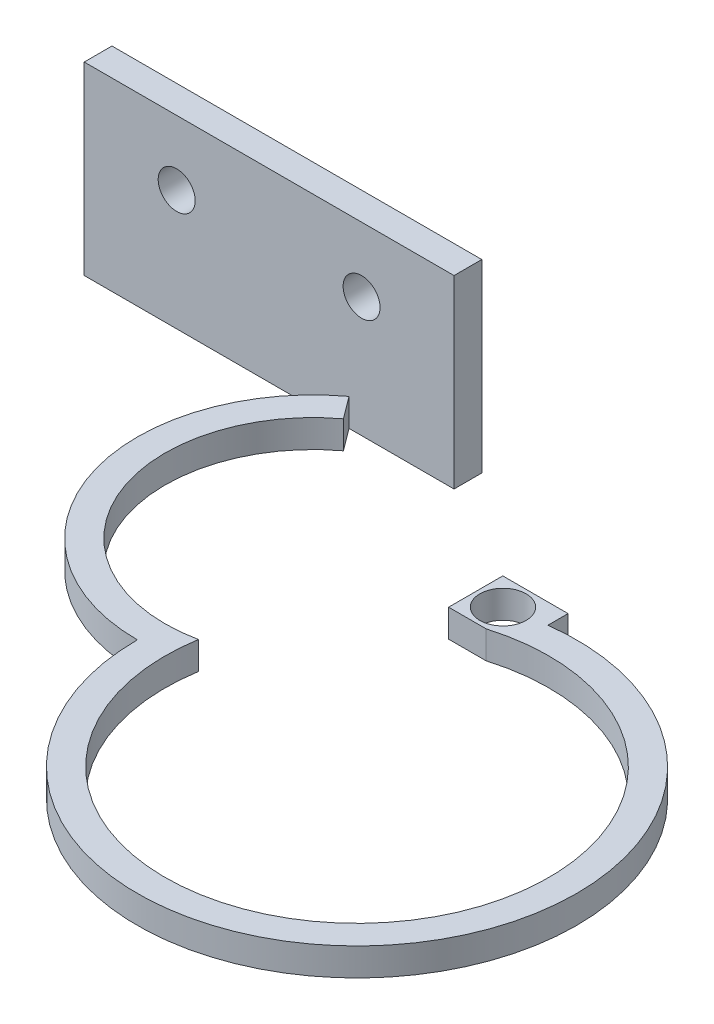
ISO-10303-21;
HEADER;
FILE_DESCRIPTION(('STEP AP214'),'2;1');
FILE_NAME('part.step','',(''),(''),'','','');
FILE_SCHEMA(('AUTOMOTIVE_DESIGN { 1 0 10303 214 1 1 1 1 }'));
ENDSEC;
DATA;
#1=APPLICATION_CONTEXT('core data for automotive mechanical design processes');
#2=APPLICATION_PROTOCOL_DEFINITION('international standard','automotive_design',2000,#1);
#3=PRODUCT_CONTEXT('',#1,'mechanical');
#4=PRODUCT('Part','Part','',(#3));
#5=PRODUCT_RELATED_PRODUCT_CATEGORY('part','',(#4));
#6=PRODUCT_DEFINITION_FORMATION('','',#4);
#7=PRODUCT_DEFINITION_CONTEXT('part definition',#1,'design');
#8=PRODUCT_DEFINITION('design','',#6,#7);
#9=PRODUCT_DEFINITION_SHAPE('','',#8);
#10=(LENGTH_UNIT() NAMED_UNIT(*) SI_UNIT(.MILLI.,.METRE.));
#11=(NAMED_UNIT(*) PLANE_ANGLE_UNIT() SI_UNIT($,.RADIAN.));
#12=(NAMED_UNIT(*) SI_UNIT($,.STERADIAN.) SOLID_ANGLE_UNIT());
#13=UNCERTAINTY_MEASURE_WITH_UNIT(LENGTH_MEASURE(1.E-05),#10,'distance_accuracy_value','');
#14=(GEOMETRIC_REPRESENTATION_CONTEXT(3) GLOBAL_UNCERTAINTY_ASSIGNED_CONTEXT((#13)) GLOBAL_UNIT_ASSIGNED_CONTEXT((#10,
#11,#12)) REPRESENTATION_CONTEXT('',''));
#15=CARTESIAN_POINT('',(0.,0.,0.));
#16=DIRECTION('',(0.,0.,1.));
#17=DIRECTION('',(1.,0.,0.));
#18=AXIS2_PLACEMENT_3D('',#15,#16,#17);
#19=CARTESIAN_POINT('',(40.,3.,18.2445157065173));
#20=DIRECTION('',(0.,-1.,0.));
#21=DIRECTION('',(0.,0.,-1.));
#22=AXIS2_PLACEMENT_3D('',#19,#20,#21);
#23=CYLINDRICAL_SURFACE('',#22,19.0092646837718);
#24=CARTESIAN_POINT('',(40.,0.,18.2445157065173));
#25=DIRECTION('',(0.,-1.,0.));
#26=DIRECTION('',(0.,0.,-1.));
#27=AXIS2_PLACEMENT_3D('',#24,#25,#26);
#28=CIRCLE('',#27,19.0092646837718);
#29=CARTESIAN_POINT('',(40.,0.,37.2537803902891));
#30=VERTEX_POINT('',#29);
#31=CARTESIAN_POINT('',(28.6440815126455,0.,3.));
#32=VERTEX_POINT('',#31);
#33=EDGE_CURVE('E144',#30,#32,#28,.T.);
#34=ORIENTED_EDGE('',*,*,#33,.F.);
#35=DIRECTION('',(0.,-1.,0.));
#36=VECTOR('',#35,1.);
#37=CARTESIAN_POINT('',(40.,3.,37.2537803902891));
#38=LINE('',#37,#36);
#39=CARTESIAN_POINT('',(40.,3.,37.2537803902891));
#40=VERTEX_POINT('',#39);
#41=EDGE_CURVE('E12',#40,#30,#38,.T.);
#42=ORIENTED_EDGE('',*,*,#41,.F.);
#43=CARTESIAN_POINT('',(40.,3.,18.2445157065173));
#44=DIRECTION('',(0.,-1.,0.));
#45=DIRECTION('',(0.,0.,-1.));
#46=AXIS2_PLACEMENT_3D('',#43,#44,#45);
#47=CIRCLE('',#46,19.0092646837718);
#48=CARTESIAN_POINT('',(28.6440815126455,3.,3.));
#49=VERTEX_POINT('',#48);
#50=EDGE_CURVE('E168',#40,#49,#47,.T.);
#51=ORIENTED_EDGE('',*,*,#50,.T.);
#52=DIRECTION('',(0.,-1.,0.));
#53=VECTOR('',#52,1.);
#54=CARTESIAN_POINT('',(28.6440815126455,3.,3.));
#55=LINE('',#54,#53);
#56=EDGE_CURVE('E44',#49,#32,#55,.T.);
#57=ORIENTED_EDGE('',*,*,#56,.T.);
#58=EDGE_LOOP('',(#34,#42,#51,#57));
#59=FACE_BOUND('',#58,.T.);
#60=ADVANCED_FACE('F41',(#59),#23,.T.);
#61=CARTESIAN_POINT('',(63.7580391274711,3.,37.2537803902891));
#62=DIRECTION('',(0.,-1.,0.));
#63=DIRECTION('',(0.,0.,-1.));
#64=AXIS2_PLACEMENT_3D('',#61,#62,#63);
#65=CYLINDRICAL_SURFACE('',#64,23.7580391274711);
#66=CARTESIAN_POINT('',(63.7580391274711,0.,37.2537803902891));
#67=DIRECTION('',(0.,-1.,0.));
#68=DIRECTION('',(0.,0.,1.));
#69=AXIS2_PLACEMENT_3D('',#66,#67,#68);
#70=CIRCLE('',#69,23.7580391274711);
#71=CARTESIAN_POINT('',(60.8324278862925,0.,13.6765621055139));
#72=VERTEX_POINT('',#71);
#73=EDGE_CURVE('E166',#72,#30,#70,.T.);
#74=ORIENTED_EDGE('',*,*,#73,.F.);
#75=DIRECTION('',(0.,-1.,0.));
#76=VECTOR('',#75,1.);
#77=CARTESIAN_POINT('',(60.8324278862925,3.,13.6765621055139));
#78=LINE('',#77,#76);
#79=CARTESIAN_POINT('',(60.8324278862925,3.,13.6765621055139));
#80=VERTEX_POINT('',#79);
#81=EDGE_CURVE('E50',#80,#72,#78,.T.);
#82=ORIENTED_EDGE('',*,*,#81,.F.);
#83=CARTESIAN_POINT('',(63.7580391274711,3.,37.2537803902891));
#84=DIRECTION('',(0.,-1.,0.));
#85=DIRECTION('',(0.,0.,1.));
#86=AXIS2_PLACEMENT_3D('',#83,#84,#85);
#87=CIRCLE('',#86,23.7580391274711);
#88=EDGE_CURVE('E134',#80,#40,#87,.T.);
#89=ORIENTED_EDGE('',*,*,#88,.T.);
#90=ORIENTED_EDGE('',*,*,#41,.T.);
#91=EDGE_LOOP('',(#74,#82,#89,#90));
#92=FACE_BOUND('',#91,.T.);
#93=ADVANCED_FACE('F182',(#92),#65,.T.);
#94=CARTESIAN_POINT('',(60.8324278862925,3.,13.6765621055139));
#95=DIRECTION('',(1.,0.,0.));
#96=DIRECTION('',(0.,0.,-1.));
#97=AXIS2_PLACEMENT_3D('',#94,#95,#96);
#98=PLANE('',#97);
#99=DIRECTION('',(0.,0.,1.));
#100=VECTOR('',#99,1.);
#101=CARTESIAN_POINT('',(60.8324278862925,0.,13.6765621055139));
#102=LINE('',#101,#100);
#103=CARTESIAN_POINT('',(60.8324278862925,0.,11.5));
#104=VERTEX_POINT('',#103);
#105=EDGE_CURVE('E121',#104,#72,#102,.T.);
#106=ORIENTED_EDGE('',*,*,#105,.F.);
#107=DIRECTION('',(0.,-1.,0.));
#108=VECTOR('',#107,1.);
#109=CARTESIAN_POINT('',(60.8324278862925,3.,11.5));
#110=LINE('',#109,#108);
#111=CARTESIAN_POINT('',(60.8324278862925,3.,11.5));
#112=VERTEX_POINT('',#111);
#113=EDGE_CURVE('E116',#112,#104,#110,.T.);
#114=ORIENTED_EDGE('',*,*,#113,.F.);
#115=DIRECTION('',(0.,0.,1.));
#116=VECTOR('',#115,1.);
#117=CARTESIAN_POINT('',(60.8324278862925,3.,13.6765621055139));
#118=LINE('',#117,#116);
#119=EDGE_CURVE('E119',#112,#80,#118,.T.);
#120=ORIENTED_EDGE('',*,*,#119,.T.);
#121=ORIENTED_EDGE('',*,*,#81,.T.);
#122=EDGE_LOOP('',(#106,#114,#120,#121));
#123=FACE_BOUND('',#122,.T.);
#124=ADVANCED_FACE('F118',(#123),#98,.T.);
#125=CARTESIAN_POINT('',(60.8324278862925,3.,11.5));
#126=DIRECTION('',(0.,0.,-1.));
#127=DIRECTION('',(-1.,0.,0.));
#128=AXIS2_PLACEMENT_3D('',#125,#126,#127);
#129=PLANE('',#128);
#130=DIRECTION('',(1.,0.,0.));
#131=VECTOR('',#130,1.);
#132=CARTESIAN_POINT('',(60.8324278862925,0.,11.5));
#133=LINE('',#132,#131);
#134=CARTESIAN_POINT('',(53.7716240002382,0.,11.5));
#135=VERTEX_POINT('',#134);
#136=EDGE_CURVE('E163',#135,#104,#133,.T.);
#137=ORIENTED_EDGE('',*,*,#136,.F.);
#138=DIRECTION('',(0.,-1.,0.));
#139=VECTOR('',#138,1.);
#140=CARTESIAN_POINT('',(53.7716240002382,3.,11.5));
#141=LINE('',#140,#139);
#142=CARTESIAN_POINT('',(53.7716240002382,3.,11.5));
#143=VERTEX_POINT('',#142);
#144=EDGE_CURVE('E126',#143,#135,#141,.T.);
#145=ORIENTED_EDGE('',*,*,#144,.F.);
#146=DIRECTION('',(1.,0.,0.));
#147=VECTOR('',#146,1.);
#148=CARTESIAN_POINT('',(60.8324278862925,3.,11.5));
#149=LINE('',#148,#147);
#150=EDGE_CURVE('E132',#143,#112,#149,.T.);
#151=ORIENTED_EDGE('',*,*,#150,.T.);
#152=ORIENTED_EDGE('',*,*,#113,.T.);
#153=EDGE_LOOP('',(#137,#145,#151,#152));
#154=FACE_BOUND('',#153,.T.);
#155=ADVANCED_FACE('F136',(#154),#129,.T.);
#156=CARTESIAN_POINT('',(53.7716240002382,3.,17.3594766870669));
#157=DIRECTION('',(-1.,0.,0.));
#158=DIRECTION('',(0.,0.,1.));
#159=AXIS2_PLACEMENT_3D('',#156,#157,#158);
#160=PLANE('',#159);
#161=DIRECTION('',(0.,0.,-1.));
#162=VECTOR('',#161,1.);
#163=CARTESIAN_POINT('',(53.7716240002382,0.,17.3594766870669));
#164=LINE('',#163,#162);
#165=CARTESIAN_POINT('',(53.7716240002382,0.,17.3594766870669));
#166=VERTEX_POINT('',#165);
#167=EDGE_CURVE('E160',#166,#135,#164,.T.);
#168=ORIENTED_EDGE('',*,*,#167,.F.);
#169=DIRECTION('',(0.,-1.,0.));
#170=VECTOR('',#169,1.);
#171=CARTESIAN_POINT('',(53.7716240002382,3.,17.3594766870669));
#172=LINE('',#171,#170);
#173=CARTESIAN_POINT('',(53.7716240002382,3.,17.3594766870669));
#174=VERTEX_POINT('',#173);
#175=EDGE_CURVE('E172',#174,#166,#172,.T.);
#176=ORIENTED_EDGE('',*,*,#175,.F.);
#177=DIRECTION('',(0.,0.,-1.));
#178=VECTOR('',#177,1.);
#179=CARTESIAN_POINT('',(53.7716240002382,3.,17.3594766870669));
#180=LINE('',#179,#178);
#181=EDGE_CURVE('E137',#174,#143,#180,.T.);
#182=ORIENTED_EDGE('',*,*,#181,.T.);
#183=ORIENTED_EDGE('',*,*,#144,.T.);
#184=EDGE_LOOP('',(#168,#176,#182,#183));
#185=FACE_BOUND('',#184,.T.);
#186=ADVANCED_FACE('F195',(#185),#160,.T.);
#187=CARTESIAN_POINT('',(57.8324278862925,3.,17.3594766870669));
#188=DIRECTION('',(0.,0.,1.));
#189=DIRECTION('',(1.,0.,0.));
#190=AXIS2_PLACEMENT_3D('',#187,#188,#189);
#191=PLANE('',#190);
#192=DIRECTION('',(-1.,0.,0.));
#193=VECTOR('',#192,1.);
#194=CARTESIAN_POINT('',(57.8324278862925,0.,17.3594766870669));
#195=LINE('',#194,#193);
#196=CARTESIAN_POINT('',(57.8324278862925,0.,17.3594766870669));
#197=VERTEX_POINT('',#196);
#198=EDGE_CURVE('E157',#197,#166,#195,.T.);
#199=ORIENTED_EDGE('',*,*,#198,.F.);
#200=DIRECTION('',(0.,-1.,0.));
#201=VECTOR('',#200,1.);
#202=CARTESIAN_POINT('',(57.8324278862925,3.,17.3594766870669));
#203=LINE('',#202,#201);
#204=CARTESIAN_POINT('',(57.8324278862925,3.,17.3594766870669));
#205=VERTEX_POINT('',#204);
#206=EDGE_CURVE('E174',#205,#197,#203,.T.);
#207=ORIENTED_EDGE('',*,*,#206,.F.);
#208=DIRECTION('',(-1.,0.,0.));
#209=VECTOR('',#208,1.);
#210=CARTESIAN_POINT('',(57.8324278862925,3.,17.3594766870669));
#211=LINE('',#210,#209);
#212=EDGE_CURVE('E139',#205,#174,#211,.T.);
#213=ORIENTED_EDGE('',*,*,#212,.T.);
#214=ORIENTED_EDGE('',*,*,#175,.T.);
#215=EDGE_LOOP('',(#199,#207,#213,#214));
#216=FACE_BOUND('',#215,.T.);
#217=ADVANCED_FACE('F198',(#216),#191,.T.);
#218=CARTESIAN_POINT('',(63.7580391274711,3.,37.2537803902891));
#219=DIRECTION('',(0.,-1.,0.));
#220=DIRECTION('',(0.,0.,-1.));
#221=AXIS2_PLACEMENT_3D('',#218,#219,#220);
#222=CYLINDRICAL_SURFACE('',#221,20.7580391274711);
#223=CARTESIAN_POINT('',(63.7580391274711,0.,37.2537803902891));
#224=DIRECTION('',(0.,1.,0.));
#225=DIRECTION('',(0.,0.,1.));
#226=AXIS2_PLACEMENT_3D('',#223,#224,#225);
#227=CIRCLE('',#226,20.7580391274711);
#228=CARTESIAN_POINT('',(43.2700652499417,0.,33.9162491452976));
#229=VERTEX_POINT('',#228);
#230=EDGE_CURVE('E154',#229,#197,#227,.T.);
#231=ORIENTED_EDGE('',*,*,#230,.F.);
#232=DIRECTION('',(0.,-1.,0.));
#233=VECTOR('',#232,1.);
#234=CARTESIAN_POINT('',(43.2700652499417,3.,33.9162491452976));
#235=LINE('',#234,#233);
#236=CARTESIAN_POINT('',(43.2700652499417,3.,33.9162491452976));
#237=VERTEX_POINT('',#236);
#238=EDGE_CURVE('E176',#237,#229,#235,.T.);
#239=ORIENTED_EDGE('',*,*,#238,.F.);
#240=CARTESIAN_POINT('',(63.7580391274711,3.,37.2537803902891));
#241=DIRECTION('',(0.,1.,0.));
#242=DIRECTION('',(0.,0.,1.));
#243=AXIS2_PLACEMENT_3D('',#240,#241,#242);
#244=CIRCLE('',#243,20.7580391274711);
#245=EDGE_CURVE('E240',#237,#205,#244,.T.);
#246=ORIENTED_EDGE('',*,*,#245,.T.);
#247=ORIENTED_EDGE('',*,*,#206,.T.);
#248=EDGE_LOOP('',(#231,#239,#246,#247));
#249=FACE_BOUND('',#248,.T.);
#250=ADVANCED_FACE('F202',(#249),#222,.F.);
#251=CARTESIAN_POINT('',(40.,3.,18.2445157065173));
#252=DIRECTION('',(0.,-1.,0.));
#253=DIRECTION('',(0.,0.,-1.));
#254=AXIS2_PLACEMENT_3D('',#251,#252,#253);
#255=CYLINDRICAL_SURFACE('',#254,16.0092646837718);
#256=CARTESIAN_POINT('',(40.,0.,18.2445157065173));
#257=DIRECTION('',(0.,1.,0.));
#258=DIRECTION('',(0.,0.,-1.));
#259=AXIS2_PLACEMENT_3D('',#256,#257,#258);
#260=CIRCLE('',#259,16.0092646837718);
#261=CARTESIAN_POINT('',(30.4362473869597,0.,5.40585566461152));
#262=VERTEX_POINT('',#261);
#263=EDGE_CURVE('E151',#262,#229,#260,.T.);
#264=ORIENTED_EDGE('',*,*,#263,.F.);
#265=DIRECTION('',(0.,-1.,0.));
#266=VECTOR('',#265,1.);
#267=CARTESIAN_POINT('',(30.4362473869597,3.,5.40585566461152));
#268=LINE('',#267,#266);
#269=CARTESIAN_POINT('',(30.4362473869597,3.,5.40585566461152));
#270=VERTEX_POINT('',#269);
#271=EDGE_CURVE('E177',#270,#262,#268,.T.);
#272=ORIENTED_EDGE('',*,*,#271,.F.);
#273=CARTESIAN_POINT('',(40.,3.,18.2445157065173));
#274=DIRECTION('',(0.,1.,0.));
#275=DIRECTION('',(0.,0.,-1.));
#276=AXIS2_PLACEMENT_3D('',#273,#274,#275);
#277=CIRCLE('',#276,16.0092646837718);
#278=EDGE_CURVE('E237',#270,#237,#277,.T.);
#279=ORIENTED_EDGE('',*,*,#278,.T.);
#280=ORIENTED_EDGE('',*,*,#238,.T.);
#281=EDGE_LOOP('',(#264,#272,#279,#280));
#282=FACE_BOUND('',#281,.T.);
#283=ADVANCED_FACE('F206',(#282),#255,.F.);
#284=CARTESIAN_POINT('',(28.6440815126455,3.,3.));
#285=DIRECTION('',(0.801951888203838,0.,-0.597388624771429));
#286=DIRECTION('',(-0.597388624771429,0.,-0.801951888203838));
#287=AXIS2_PLACEMENT_3D('',#284,#285,#286);
#288=PLANE('',#287);
#289=DIRECTION('',(0.597388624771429,0.,0.801951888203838));
#290=VECTOR('',#289,1.);
#291=CARTESIAN_POINT('',(28.6440815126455,0.,3.));
#292=LINE('',#291,#290);
#293=EDGE_CURVE('E147',#32,#262,#292,.T.);
#294=ORIENTED_EDGE('',*,*,#293,.F.);
#295=ORIENTED_EDGE('',*,*,#56,.F.);
#296=DIRECTION('',(0.597388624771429,0.,0.801951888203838));
#297=VECTOR('',#296,1.);
#298=CARTESIAN_POINT('',(28.6440815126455,3.,3.));
#299=LINE('',#298,#297);
#300=EDGE_CURVE('E235',#49,#270,#299,.T.);
#301=ORIENTED_EDGE('',*,*,#300,.T.);
#302=ORIENTED_EDGE('',*,*,#271,.T.);
#303=EDGE_LOOP('',(#294,#295,#301,#302));
#304=FACE_BOUND('',#303,.T.);
#305=ADVANCED_FACE('F179',(#304),#288,.T.);
#306=CARTESIAN_POINT('',(40.,3.,18.2445157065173));
#307=DIRECTION('',(0.,-1.,0.));
#308=DIRECTION('',(0.,0.,-1.));
#309=AXIS2_PLACEMENT_3D('',#306,#307,#308);
#310=PLANE('',#309);
#311=CARTESIAN_POINT('',(56.7063422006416,3.,14.4133368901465));
#312=DIRECTION('',(0.,-1.,0.));
#313=DIRECTION('',(0.,0.,-1.));
#314=AXIS2_PLACEMENT_3D('',#311,#312,#313);
#315=CIRCLE('',#314,2.49999999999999);
#316=CARTESIAN_POINT('',(56.7063422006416,3.,11.9133368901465));
#317=VERTEX_POINT('',#316);
#318=EDGE_CURVE('E148',#317,#317,#315,.T.);
#319=ORIENTED_EDGE('',*,*,#318,.T.);
#320=EDGE_LOOP('',(#319));
#321=FACE_BOUND('',#320,.T.);
#322=ORIENTED_EDGE('',*,*,#50,.F.);
#323=ORIENTED_EDGE('',*,*,#88,.F.);
#324=ORIENTED_EDGE('',*,*,#119,.F.);
#325=ORIENTED_EDGE('',*,*,#150,.F.);
#326=ORIENTED_EDGE('',*,*,#181,.F.);
#327=ORIENTED_EDGE('',*,*,#212,.F.);
#328=ORIENTED_EDGE('',*,*,#245,.F.);
#329=ORIENTED_EDGE('',*,*,#278,.F.);
#330=ORIENTED_EDGE('',*,*,#300,.F.);
#331=EDGE_LOOP('',(#322,#323,#324,#325,#326,#327,#328,#329,#330));
#332=FACE_BOUND('',#331,.T.);
#333=ADVANCED_FACE('F130',(#321,#332),#310,.F.);
#334=CARTESIAN_POINT('',(40.,0.,18.2445157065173));
#335=DIRECTION('',(0.,-1.,0.));
#336=DIRECTION('',(0.,0.,-1.));
#337=AXIS2_PLACEMENT_3D('',#334,#335,#336);
#338=PLANE('',#337);
#339=CARTESIAN_POINT('',(56.7063422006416,0.,14.4133368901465));
#340=DIRECTION('',(0.,-1.,0.));
#341=DIRECTION('',(0.,0.,-1.));
#342=AXIS2_PLACEMENT_3D('',#339,#340,#341);
#343=CIRCLE('',#342,2.49999999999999);
#344=CARTESIAN_POINT('',(56.7063422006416,0.,11.9133368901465));
#345=VERTEX_POINT('',#344);
#346=EDGE_CURVE('E230',#345,#345,#343,.T.);
#347=ORIENTED_EDGE('',*,*,#346,.F.);
#348=EDGE_LOOP('',(#347));
#349=FACE_BOUND('',#348,.T.);
#350=ORIENTED_EDGE('',*,*,#33,.T.);
#351=ORIENTED_EDGE('',*,*,#293,.T.);
#352=ORIENTED_EDGE('',*,*,#263,.T.);
#353=ORIENTED_EDGE('',*,*,#230,.T.);
#354=ORIENTED_EDGE('',*,*,#198,.T.);
#355=ORIENTED_EDGE('',*,*,#167,.T.);
#356=ORIENTED_EDGE('',*,*,#136,.T.);
#357=ORIENTED_EDGE('',*,*,#105,.T.);
#358=ORIENTED_EDGE('',*,*,#73,.T.);
#359=EDGE_LOOP('',(#350,#351,#352,#353,#354,#355,#356,#357,#358));
#360=FACE_BOUND('',#359,.T.);
#361=ADVANCED_FACE('F181',(#349,#360),#338,.T.);
#362=CARTESIAN_POINT('',(56.7063422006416,3.,14.4133368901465));
#363=DIRECTION('',(0.,-1.,0.));
#364=DIRECTION('',(0.,0.,-1.));
#365=AXIS2_PLACEMENT_3D('',#362,#363,#364);
#366=CYLINDRICAL_SURFACE('',#365,2.49999999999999);
#367=ORIENTED_EDGE('',*,*,#318,.F.);
#368=EDGE_LOOP('',(#367));
#369=FACE_BOUND('',#368,.T.);
#370=ORIENTED_EDGE('',*,*,#346,.T.);
#371=EDGE_LOOP('',(#370));
#372=FACE_BOUND('',#371,.T.);
#373=ADVANCED_FACE('F218',(#369,#372),#366,.F.);
#374=CLOSED_SHELL('',(#60,#93,#124,#155,#186,#217,#250,#283,#305,#333,#361,#373));
#375=MANIFOLD_SOLID_BREP('B2',#374);
#376=CARTESIAN_POINT('',(0.,20.,3.));
#377=DIRECTION('',(0.,0.,-1.));
#378=DIRECTION('',(-1.,0.,0.));
#379=AXIS2_PLACEMENT_3D('',#376,#377,#378);
#380=PLANE('',#379);
#381=DIRECTION('',(1.,0.,0.));
#382=VECTOR('',#381,1.);
#383=CARTESIAN_POINT('',(0.,0.,3.));
#384=LINE('',#383,#382);
#385=CARTESIAN_POINT('',(0.,0.,3.));
#386=VERTEX_POINT('',#385);
#387=CARTESIAN_POINT('',(40.,0.,3.));
#388=VERTEX_POINT('',#387);
#389=EDGE_CURVE('E363',#386,#388,#384,.T.);
#390=ORIENTED_EDGE('',*,*,#389,.T.);
#391=DIRECTION('',(0.,1.,0.));
#392=VECTOR('',#391,1.);
#393=CARTESIAN_POINT('',(40.,0.,3.));
#394=LINE('',#393,#392);
#395=CARTESIAN_POINT('',(40.,20.,3.));
#396=VERTEX_POINT('',#395);
#397=EDGE_CURVE('E366',#388,#396,#394,.T.);
#398=ORIENTED_EDGE('',*,*,#397,.T.);
#399=DIRECTION('',(-1.,0.,0.));
#400=VECTOR('',#399,1.);
#401=CARTESIAN_POINT('',(0.,20.,3.));
#402=LINE('',#401,#400);
#403=CARTESIAN_POINT('',(0.,20.,3.));
#404=VERTEX_POINT('',#403);
#405=EDGE_CURVE('E333',#396,#404,#402,.T.);
#406=ORIENTED_EDGE('',*,*,#405,.T.);
#407=DIRECTION('',(0.,-1.,0.));
#408=VECTOR('',#407,1.);
#409=CARTESIAN_POINT('',(0.,0.,3.));
#410=LINE('',#409,#408);
#411=EDGE_CURVE('E368',#404,#386,#410,.T.);
#412=ORIENTED_EDGE('',*,*,#411,.T.);
#413=EDGE_LOOP('',(#390,#398,#406,#412));
#414=FACE_BOUND('',#413,.T.);
#415=CARTESIAN_POINT('',(10.,13.,3.));
#416=DIRECTION('',(0.,0.,1.));
#417=DIRECTION('',(1.,0.,0.));
#418=AXIS2_PLACEMENT_3D('',#415,#416,#417);
#419=CIRCLE('',#418,2.);
#420=CARTESIAN_POINT('',(12.,13.,3.));
#421=VERTEX_POINT('',#420);
#422=EDGE_CURVE('E383',#421,#421,#419,.T.);
#423=ORIENTED_EDGE('',*,*,#422,.F.);
#424=EDGE_LOOP('',(#423));
#425=FACE_BOUND('',#424,.T.);
#426=CARTESIAN_POINT('',(30.,13.,3.));
#427=DIRECTION('',(0.,0.,1.));
#428=DIRECTION('',(1.,0.,0.));
#429=AXIS2_PLACEMENT_3D('',#426,#427,#428);
#430=CIRCLE('',#429,2.);
#431=CARTESIAN_POINT('',(32.,13.,3.));
#432=VERTEX_POINT('',#431);
#433=EDGE_CURVE('E398',#432,#432,#430,.T.);
#434=ORIENTED_EDGE('',*,*,#433,.F.);
#435=EDGE_LOOP('',(#434));
#436=FACE_BOUND('',#435,.T.);
#437=ADVANCED_FACE('F316',(#414,#425,#436),#380,.F.);
#438=CARTESIAN_POINT('',(0.,20.,0.));
#439=DIRECTION('',(0.,0.,-1.));
#440=DIRECTION('',(-1.,0.,0.));
#441=AXIS2_PLACEMENT_3D('',#438,#439,#440);
#442=PLANE('',#441);
#443=CARTESIAN_POINT('',(10.,13.,0.));
#444=DIRECTION('',(0.,0.,1.));
#445=DIRECTION('',(1.,0.,0.));
#446=AXIS2_PLACEMENT_3D('',#443,#444,#445);
#447=CIRCLE('',#446,2.);
#448=CARTESIAN_POINT('',(12.,13.,0.));
#449=VERTEX_POINT('',#448);
#450=EDGE_CURVE('E395',#449,#449,#447,.T.);
#451=ORIENTED_EDGE('',*,*,#450,.T.);
#452=EDGE_LOOP('',(#451));
#453=FACE_BOUND('',#452,.T.);
#454=DIRECTION('',(0.,-1.,0.));
#455=VECTOR('',#454,1.);
#456=CARTESIAN_POINT('',(0.,0.,0.));
#457=LINE('',#456,#455);
#458=CARTESIAN_POINT('',(0.,20.,0.));
#459=VERTEX_POINT('',#458);
#460=CARTESIAN_POINT('',(0.,0.,0.));
#461=VERTEX_POINT('',#460);
#462=EDGE_CURVE('E380',#459,#461,#457,.T.);
#463=ORIENTED_EDGE('',*,*,#462,.F.);
#464=DIRECTION('',(-1.,0.,0.));
#465=VECTOR('',#464,1.);
#466=CARTESIAN_POINT('',(0.,20.,0.));
#467=LINE('',#466,#465);
#468=CARTESIAN_POINT('',(40.,20.,0.));
#469=VERTEX_POINT('',#468);
#470=EDGE_CURVE('E356',#469,#459,#467,.T.);
#471=ORIENTED_EDGE('',*,*,#470,.F.);
#472=DIRECTION('',(0.,1.,0.));
#473=VECTOR('',#472,1.);
#474=CARTESIAN_POINT('',(40.,0.,0.));
#475=LINE('',#474,#473);
#476=CARTESIAN_POINT('',(40.,0.,0.));
#477=VERTEX_POINT('',#476);
#478=EDGE_CURVE('E350',#477,#469,#475,.T.);
#479=ORIENTED_EDGE('',*,*,#478,.F.);
#480=DIRECTION('',(1.,0.,0.));
#481=VECTOR('',#480,1.);
#482=CARTESIAN_POINT('',(0.,0.,0.));
#483=LINE('',#482,#481);
#484=EDGE_CURVE('E372',#461,#477,#483,.T.);
#485=ORIENTED_EDGE('',*,*,#484,.F.);
#486=EDGE_LOOP('',(#463,#471,#479,#485));
#487=FACE_BOUND('',#486,.T.);
#488=CARTESIAN_POINT('',(30.,13.,0.));
#489=DIRECTION('',(0.,0.,1.));
#490=DIRECTION('',(1.,0.,0.));
#491=AXIS2_PLACEMENT_3D('',#488,#489,#490);
#492=CIRCLE('',#491,2.);
#493=CARTESIAN_POINT('',(32.,13.,0.));
#494=VERTEX_POINT('',#493);
#495=EDGE_CURVE('E401',#494,#494,#492,.T.);
#496=ORIENTED_EDGE('',*,*,#495,.T.);
#497=EDGE_LOOP('',(#496));
#498=FACE_BOUND('',#497,.T.);
#499=ADVANCED_FACE('F391',(#453,#487,#498),#442,.T.);
#500=CARTESIAN_POINT('',(0.,0.,3.));
#501=DIRECTION('',(1.,0.,0.));
#502=DIRECTION('',(0.,0.,-1.));
#503=AXIS2_PLACEMENT_3D('',#500,#501,#502);
#504=PLANE('',#503);
#505=ORIENTED_EDGE('',*,*,#462,.T.);
#506=DIRECTION('',(0.,0.,-1.));
#507=VECTOR('',#506,1.);
#508=CARTESIAN_POINT('',(0.,0.,3.));
#509=LINE('',#508,#507);
#510=EDGE_CURVE('E39',#386,#461,#509,.T.);
#511=ORIENTED_EDGE('',*,*,#510,.F.);
#512=ORIENTED_EDGE('',*,*,#411,.F.);
#513=DIRECTION('',(0.,0.,-1.));
#514=VECTOR('',#513,1.);
#515=CARTESIAN_POINT('',(0.,20.,3.));
#516=LINE('',#515,#514);
#517=EDGE_CURVE('E376',#404,#459,#516,.T.);
#518=ORIENTED_EDGE('',*,*,#517,.T.);
#519=EDGE_LOOP('',(#505,#511,#512,#518));
#520=FACE_BOUND('',#519,.T.);
#521=ADVANCED_FACE('F318',(#520),#504,.F.);
#522=CARTESIAN_POINT('',(0.,0.,3.));
#523=DIRECTION('',(0.,1.,0.));
#524=DIRECTION('',(0.,0.,1.));
#525=AXIS2_PLACEMENT_3D('',#522,#523,#524);
#526=PLANE('',#525);
#527=ORIENTED_EDGE('',*,*,#484,.T.);
#528=DIRECTION('',(0.,0.,-1.));
#529=VECTOR('',#528,1.);
#530=CARTESIAN_POINT('',(40.,0.,3.));
#531=LINE('',#530,#529);
#532=EDGE_CURVE('E325',#388,#477,#531,.T.);
#533=ORIENTED_EDGE('',*,*,#532,.F.);
#534=ORIENTED_EDGE('',*,*,#389,.F.);
#535=ORIENTED_EDGE('',*,*,#510,.T.);
#536=EDGE_LOOP('',(#527,#533,#534,#535));
#537=FACE_BOUND('',#536,.T.);
#538=ADVANCED_FACE('F371',(#537),#526,.F.);
#539=CARTESIAN_POINT('',(40.,0.,3.));
#540=DIRECTION('',(-1.,0.,0.));
#541=DIRECTION('',(0.,0.,1.));
#542=AXIS2_PLACEMENT_3D('',#539,#540,#541);
#543=PLANE('',#542);
#544=ORIENTED_EDGE('',*,*,#478,.T.);
#545=DIRECTION('',(0.,0.,-1.));
#546=VECTOR('',#545,1.);
#547=CARTESIAN_POINT('',(40.,20.,3.));
#548=LINE('',#547,#546);
#549=EDGE_CURVE('E373',#396,#469,#548,.T.);
#550=ORIENTED_EDGE('',*,*,#549,.F.);
#551=ORIENTED_EDGE('',*,*,#397,.F.);
#552=ORIENTED_EDGE('',*,*,#532,.T.);
#553=EDGE_LOOP('',(#544,#550,#551,#552));
#554=FACE_BOUND('',#553,.T.);
#555=ADVANCED_FACE('F374',(#554),#543,.F.);
#556=CARTESIAN_POINT('',(0.,20.,3.));
#557=DIRECTION('',(0.,-1.,0.));
#558=DIRECTION('',(0.,0.,-1.));
#559=AXIS2_PLACEMENT_3D('',#556,#557,#558);
#560=PLANE('',#559);
#561=ORIENTED_EDGE('',*,*,#470,.T.);
#562=ORIENTED_EDGE('',*,*,#517,.F.);
#563=ORIENTED_EDGE('',*,*,#405,.F.);
#564=ORIENTED_EDGE('',*,*,#549,.T.);
#565=EDGE_LOOP('',(#561,#562,#563,#564));
#566=FACE_BOUND('',#565,.T.);
#567=ADVANCED_FACE('F388',(#566),#560,.F.);
#568=CARTESIAN_POINT('',(10.,13.,3.));
#569=DIRECTION('',(0.,0.,-1.));
#570=DIRECTION('',(-1.,0.,0.));
#571=AXIS2_PLACEMENT_3D('',#568,#569,#570);
#572=CYLINDRICAL_SURFACE('',#571,2.);
#573=ORIENTED_EDGE('',*,*,#422,.T.);
#574=EDGE_LOOP('',(#573));
#575=FACE_BOUND('',#574,.T.);
#576=ORIENTED_EDGE('',*,*,#450,.F.);
#577=EDGE_LOOP('',(#576));
#578=FACE_BOUND('',#577,.T.);
#579=ADVANCED_FACE('F418',(#575,#578),#572,.F.);
#580=CARTESIAN_POINT('',(30.,13.,3.));
#581=DIRECTION('',(0.,0.,-1.));
#582=DIRECTION('',(-1.,0.,0.));
#583=AXIS2_PLACEMENT_3D('',#580,#581,#582);
#584=CYLINDRICAL_SURFACE('',#583,2.);
#585=ORIENTED_EDGE('',*,*,#433,.T.);
#586=EDGE_LOOP('',(#585));
#587=FACE_BOUND('',#586,.T.);
#588=ORIENTED_EDGE('',*,*,#495,.F.);
#589=EDGE_LOOP('',(#588));
#590=FACE_BOUND('',#589,.T.);
#591=ADVANCED_FACE('F407',(#587,#590),#584,.F.);
#592=CLOSED_SHELL('',(#437,#499,#521,#538,#555,#567,#579,#591));
#593=MANIFOLD_SOLID_BREP('B6',#592);
#594=ADVANCED_BREP_SHAPE_REPRESENTATION('',(#18,#375,#593),#14);
#595=SHAPE_DEFINITION_REPRESENTATION(#9,#594);
ENDSEC;
END-ISO-10303-21;
